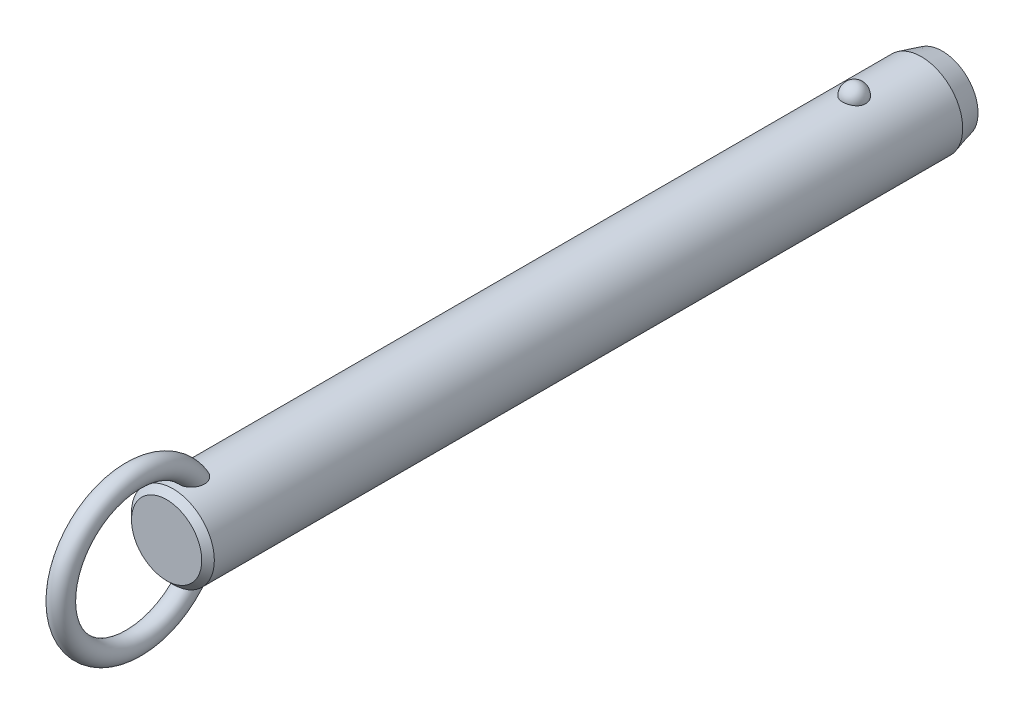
ISO-10303-21;
HEADER;
FILE_DESCRIPTION(('STEP AP214'),'2;1');
FILE_NAME('part.step','',(''),(''),'','','');
FILE_SCHEMA(('AUTOMOTIVE_DESIGN { 1 0 10303 214 1 1 1 1 }'));
ENDSEC;
DATA;
#1=APPLICATION_CONTEXT('core data for automotive mechanical design processes');
#2=APPLICATION_PROTOCOL_DEFINITION('international standard','automotive_design',2000,#1);
#3=PRODUCT_CONTEXT('',#1,'mechanical');
#4=PRODUCT('Part','Part','',(#3));
#5=PRODUCT_RELATED_PRODUCT_CATEGORY('part','',(#4));
#6=PRODUCT_DEFINITION_FORMATION('','',#4);
#7=PRODUCT_DEFINITION_CONTEXT('part definition',#1,'design');
#8=PRODUCT_DEFINITION('design','',#6,#7);
#9=PRODUCT_DEFINITION_SHAPE('','',#8);
#10=(LENGTH_UNIT() NAMED_UNIT(*) SI_UNIT(.MILLI.,.METRE.));
#11=(NAMED_UNIT(*) PLANE_ANGLE_UNIT() SI_UNIT($,.RADIAN.));
#12=(NAMED_UNIT(*) SI_UNIT($,.STERADIAN.) SOLID_ANGLE_UNIT());
#13=UNCERTAINTY_MEASURE_WITH_UNIT(LENGTH_MEASURE(1.E-05),#10,'distance_accuracy_value','');
#14=(GEOMETRIC_REPRESENTATION_CONTEXT(3) GLOBAL_UNCERTAINTY_ASSIGNED_CONTEXT((#13)) GLOBAL_UNIT_ASSIGNED_CONTEXT((#10,
#11,#12)) REPRESENTATION_CONTEXT('',''));
#15=CARTESIAN_POINT('',(0.,0.,0.));
#16=DIRECTION('',(0.,0.,1.));
#17=DIRECTION('',(1.,0.,0.));
#18=AXIS2_PLACEMENT_3D('',#15,#16,#17);
#19=CARTESIAN_POINT('',(0.,0.,119.4));
#20=DIRECTION('',(0.,0.,-1.));
#21=DIRECTION('',(-1.,0.,0.));
#22=AXIS2_PLACEMENT_3D('',#19,#20,#21);
#23=CYLINDRICAL_SURFACE('',#22,7.9);
#24=CARTESIAN_POINT('',(2.1785689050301,7.59367088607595,-2.19999999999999));
#25=CARTESIAN_POINT('',(2.17856679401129,7.59367269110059,-2.07701843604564));
#26=CARTESIAN_POINT('',(2.16853481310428,7.59657145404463,-1.95401006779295));
#27=CARTESIAN_POINT('',(2.12864689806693,7.607843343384,-1.71147811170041));
#28=CARTESIAN_POINT('',(2.09878338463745,7.61621856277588,-1.59195587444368));
#29=CARTESIAN_POINT('',(2.0199931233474,7.63749180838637,-1.3598563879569));
#30=CARTESIAN_POINT('',(1.97107475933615,7.6503878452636,-1.24727610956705));
#31=CARTESIAN_POINT('',(1.85539377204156,7.67926115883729,-1.03213234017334));
#32=CARTESIAN_POINT('',(1.78863158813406,7.69523835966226,-0.929568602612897));
#33=CARTESIAN_POINT('',(1.63856494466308,7.7285848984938,-0.736786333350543));
#34=CARTESIAN_POINT('',(1.55518140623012,7.7459606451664,-0.646630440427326));
#35=CARTESIAN_POINT('',(1.37422937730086,7.78009978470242,-0.481747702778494));
#36=CARTESIAN_POINT('',(1.27666086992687,7.79686317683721,-0.407020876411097));
#37=CARTESIAN_POINT('',(1.07024728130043,7.82786153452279,-0.275278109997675));
#38=CARTESIAN_POINT('',(0.961434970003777,7.84210353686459,-0.218212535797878));
#39=CARTESIAN_POINT('',(0.735351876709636,7.86652194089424,-0.123146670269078));
#40=CARTESIAN_POINT('',(0.618082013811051,7.87669878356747,-0.085144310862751));
#41=CARTESIAN_POINT('',(0.380637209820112,7.89170521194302,-0.0298158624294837));
#42=CARTESIAN_POINT('',(0.260550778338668,7.89662650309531,-0.0121347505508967));
#43=CARTESIAN_POINT('',(0.0190117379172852,7.90090003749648,0.00324379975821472));
#44=CARTESIAN_POINT('',(-0.102440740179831,7.90025280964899,0.00094313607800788));
#45=CARTESIAN_POINT('',(-0.341452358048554,7.89351056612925,-0.0233955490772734));
#46=CARTESIAN_POINT('',(-0.459042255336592,7.88749257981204,-0.0451545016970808));
#47=CARTESIAN_POINT('',(-0.688796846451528,7.87075812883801,-0.107408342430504));
#48=CARTESIAN_POINT('',(-0.800961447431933,7.86004158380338,-0.147903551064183));
#49=CARTESIAN_POINT('',(-1.01743634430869,7.83497131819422,-0.246799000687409));
#50=CARTESIAN_POINT('',(-1.12169791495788,7.82059709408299,-0.305300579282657));
#51=CARTESIAN_POINT('',(-1.31891765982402,7.78976470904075,-0.438549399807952));
#52=CARTESIAN_POINT('',(-1.41187469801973,7.77330633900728,-0.513298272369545));
#53=CARTESIAN_POINT('',(-1.58577142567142,7.73972434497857,-0.678622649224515));
#54=CARTESIAN_POINT('',(-1.66645140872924,7.72259402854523,-0.769470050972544));
#55=CARTESIAN_POINT('',(-1.81161503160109,7.68983776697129,-0.963538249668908));
#56=CARTESIAN_POINT('',(-1.87609753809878,7.6742119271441,-1.06675991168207));
#57=CARTESIAN_POINT('',(-1.98790138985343,7.6460202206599,-1.28401170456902));
#58=CARTESIAN_POINT('',(-2.03501994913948,7.63349104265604,-1.39815107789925));
#59=CARTESIAN_POINT('',(-2.10986724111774,7.6131449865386,-1.63301784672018));
#60=CARTESIAN_POINT('',(-2.1375965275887,7.60532797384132,-1.75374505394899));
#61=CARTESIAN_POINT('',(-2.17289256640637,7.5953195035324,-1.99782562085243));
#62=CARTESIAN_POINT('',(-2.18054294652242,7.59310471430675,-2.12116592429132));
#63=CARTESIAN_POINT('',(-2.17572919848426,7.59448538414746,-2.36741799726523));
#64=CARTESIAN_POINT('',(-2.1632656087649,7.59808068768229,-2.49032977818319));
#65=CARTESIAN_POINT('',(-2.11865035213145,7.61064035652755,-2.73161015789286));
#66=CARTESIAN_POINT('',(-2.08659579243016,7.61957823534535,-2.84999812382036));
#67=CARTESIAN_POINT('',(-2.00367799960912,7.64179982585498,-3.07955956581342));
#68=CARTESIAN_POINT('',(-1.9528140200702,7.65508371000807,-3.19073275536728));
#69=CARTESIAN_POINT('',(-1.83321113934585,7.68460381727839,-3.40337899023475));
#70=CARTESIAN_POINT('',(-1.76437735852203,7.70085556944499,-3.50479651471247));
#71=CARTESIAN_POINT('',(-1.61069526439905,7.73445734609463,-3.69446912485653));
#72=CARTESIAN_POINT('',(-1.52584634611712,7.75180741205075,-3.78272371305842));
#73=CARTESIAN_POINT('',(-1.34198059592,7.78574608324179,-3.94393987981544));
#74=CARTESIAN_POINT('',(-1.24291308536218,7.80233167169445,-4.01684434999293));
#75=CARTESIAN_POINT('',(-1.03352039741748,7.83281625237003,-4.14489386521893));
#76=CARTESIAN_POINT('',(-0.92319600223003,7.84671543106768,-4.20004014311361));
#77=CARTESIAN_POINT('',(-0.695822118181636,7.87011575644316,-4.29042017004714));
#78=CARTESIAN_POINT('',(-0.578872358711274,7.87966903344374,-4.32589112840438));
#79=CARTESIAN_POINT('',(-0.340410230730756,7.8935652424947,-4.37692226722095));
#80=CARTESIAN_POINT('',(-0.218898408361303,7.89790879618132,-4.39248482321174));
#81=CARTESIAN_POINT('',(0.0228107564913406,7.90087453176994,-4.40314405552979));
#82=CARTESIAN_POINT('',(0.142990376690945,7.89960185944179,-4.39861683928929));
#83=CARTESIAN_POINT('',(0.380829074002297,7.89171262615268,-4.37008293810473));
#84=CARTESIAN_POINT('',(0.498488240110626,7.8850962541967,-4.34607694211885));
#85=CARTESIAN_POINT('',(0.727535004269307,7.86726442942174,-4.27939317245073));
#86=CARTESIAN_POINT('',(0.838944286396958,7.85606616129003,-4.236785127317));
#87=CARTESIAN_POINT('',(1.05295421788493,7.83025654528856,-4.13408348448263));
#88=CARTESIAN_POINT('',(1.15555431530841,7.81564498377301,-4.07398879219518));
#89=CARTESIAN_POINT('',(1.35076763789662,7.7843022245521,-3.93687432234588));
#90=CARTESIAN_POINT('',(1.4432046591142,7.76754209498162,-3.85961036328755));
#91=CARTESIAN_POINT('',(1.6139111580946,7.73387857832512,-3.69076949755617));
#92=CARTESIAN_POINT('',(1.6921781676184,7.71697516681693,-3.59919010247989));
#93=CARTESIAN_POINT('',(1.83380875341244,7.6845643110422,-3.40247278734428));
#94=CARTESIAN_POINT('',(1.89689280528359,7.66908588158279,-3.29712873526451));
#95=CARTESIAN_POINT('',(2.0047823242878,7.64159441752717,-3.07707931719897));
#96=CARTESIAN_POINT('',(2.0495945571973,7.62958010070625,-2.96237743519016));
#97=CARTESIAN_POINT('',(2.11580183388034,7.61146617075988,-2.74040519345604));
#98=CARTESIAN_POINT('',(2.13929812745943,7.60484503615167,-2.63379846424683));
#99=CARTESIAN_POINT('',(2.17068242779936,7.59594664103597,-2.41813481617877));
#100=CARTESIAN_POINT('',(2.17857077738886,7.59366928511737,-2.30907795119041));
#101=CARTESIAN_POINT('',(2.1785689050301,7.59367088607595,-2.19999999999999));
#102=B_SPLINE_CURVE_WITH_KNOTS('',3,(#24,#25,#26,#27,#28,#29,#30,#31,#32,#33,#34,#35,#36,#37,
#38,#39,#40,#41,#42,#43,#44,#45,#46,#47,#48,#49,#50,#51,#52,#53,#54,#55,#56,#57,#58,#59,#60,#61,
#62,#63,#64,#65,#66,#67,#68,#69,#70,#71,#72,#73,#74,#75,#76,#77,#78,#79,#80,#81,#82,#83,#84,#85,
#86,#87,#88,#89,#90,#91,#92,#93,#94,#95,#96,#97,#98,#99,#100,#101),.UNSPECIFIED.,.T.,.F.,(4,2,2,
2,2,2,2,2,2,2,2,2,2,2,2,2,2,2,2,2,2,2,2,2,2,2,2,2,2,2,2,2,2,2,2,2,2,2,4),(0.,0.368552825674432,
0.737246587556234,1.10577831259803,1.4743009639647,1.8446206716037,2.21494081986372,
2.5842105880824,2.95344028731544,3.31611630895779,3.67875788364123,4.03628044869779,
4.39380913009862,4.75338791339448,5.11300280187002,5.47939989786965,5.8458226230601,
6.21639834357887,6.58696347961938,6.95598276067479,7.32499216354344,7.69218715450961,
8.0593967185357,8.42858578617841,8.79778880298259,9.16834203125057,9.5388695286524,
9.90482699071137,10.2707407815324,10.6298333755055,10.9889132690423,11.3466585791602,
11.7044262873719,12.0676511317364,12.4309391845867,12.8004764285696,13.1698767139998,
13.4967701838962,13.8236564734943),.UNSPECIFIED.);
#103=CARTESIAN_POINT('',(2.1785689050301,7.59367088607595,-2.19999999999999));
#104=VERTEX_POINT('',#103);
#105=EDGE_CURVE('E41',#104,#104,#102,.T.);
#106=ORIENTED_EDGE('',*,*,#105,.T.);
#107=EDGE_LOOP('',(#106));
#108=FACE_BOUND('',#107,.T.);
#109=CARTESIAN_POINT('',(0.,0.,127.72));
#110=DIRECTION('',(0.,0.,1.));
#111=DIRECTION('',(1.,0.,0.));
#112=AXIS2_PLACEMENT_3D('',#109,#110,#111);
#113=CIRCLE('',#112,7.9);
#114=CARTESIAN_POINT('',(7.9,0.,127.72));
#115=VERTEX_POINT('',#114);
#116=EDGE_CURVE('E10',#115,#115,#113,.F.);
#117=ORIENTED_EDGE('',*,*,#116,.T.);
#118=EDGE_LOOP('',(#117));
#119=FACE_BOUND('',#118,.T.);
#120=CARTESIAN_POINT('',(-0.630969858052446,-7.87476203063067,121.612432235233));
#121=CARTESIAN_POINT('',(-0.73418033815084,-7.8664899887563,121.647285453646));
#122=CARTESIAN_POINT('',(-0.834476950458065,-7.85639291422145,121.690816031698));
#123=CARTESIAN_POINT('',(-1.02620356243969,-7.83366343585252,121.794094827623));
#124=CARTESIAN_POINT('',(-1.1176141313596,-7.82102565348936,121.853877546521));
#125=CARTESIAN_POINT('',(-1.28877277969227,-7.79464922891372,121.987839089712));
#126=CARTESIAN_POINT('',(-1.36854014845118,-7.78091246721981,122.061993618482));
#127=CARTESIAN_POINT('',(-1.5146152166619,-7.75380398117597,122.222494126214));
#128=CARTESIAN_POINT('',(-1.58092966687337,-7.74043207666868,122.308833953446));
#129=CARTESIAN_POINT('',(-1.70019064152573,-7.71512522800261,122.492978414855));
#130=CARTESIAN_POINT('',(-1.75284037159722,-7.70322473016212,122.590979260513));
#131=CARTESIAN_POINT('',(-1.84263464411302,-7.68224112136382,122.794102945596));
#132=CARTESIAN_POINT('',(-1.87977299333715,-7.6731591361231,122.899228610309));
#133=CARTESIAN_POINT('',(-1.94152728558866,-7.65777930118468,123.123284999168));
#134=CARTESIAN_POINT('',(-1.96475471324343,-7.65179654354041,123.242616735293));
#135=CARTESIAN_POINT('',(-1.99449499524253,-7.64409642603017,123.48342986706));
#136=CARTESIAN_POINT('',(-2.0010005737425,-7.64238092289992,123.604912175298));
#137=CARTESIAN_POINT('',(-1.99856014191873,-7.64302120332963,123.868340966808));
#138=CARTESIAN_POINT('',(-1.98680021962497,-7.64611845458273,124.01025654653));
#139=CARTESIAN_POINT('',(-1.94457772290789,-7.65696186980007,124.291118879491));
#140=CARTESIAN_POINT('',(-1.91409393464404,-7.66471330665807,124.430062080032));
#141=CARTESIAN_POINT('',(-1.82768670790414,-7.68582947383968,124.731939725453));
#142=CARTESIAN_POINT('',(-1.76772963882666,-7.70003779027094,124.893686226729));
#143=CARTESIAN_POINT('',(-1.65998501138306,-7.72371550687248,125.127695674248));
#144=CARTESIAN_POINT('',(-1.62107967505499,-7.73200670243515,125.204297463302));
#145=CARTESIAN_POINT('',(-1.53727726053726,-7.7491037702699,125.354079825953));
#146=CARTESIAN_POINT('',(-1.4923821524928,-7.75790947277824,125.427261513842));
#147=CARTESIAN_POINT('',(-1.37397050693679,-7.77993338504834,125.60288382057));
#148=CARTESIAN_POINT('',(-1.29690364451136,-7.79328473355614,125.702955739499));
#149=CARTESIAN_POINT('',(-1.1288548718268,-7.81939266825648,125.890714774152));
#150=CARTESIAN_POINT('',(-1.03789926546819,-7.83215032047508,125.978424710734));
#151=CARTESIAN_POINT('',(-0.869532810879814,-7.85231710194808,126.113414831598));
#152=CARTESIAN_POINT('',(-0.795716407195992,-7.86021093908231,126.165076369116));
#153=CARTESIAN_POINT('',(-0.640813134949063,-7.87434920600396,126.256381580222));
#154=CARTESIAN_POINT('',(-0.559737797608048,-7.88059619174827,126.29604389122));
#155=CARTESIAN_POINT('',(-0.406456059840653,-7.88984116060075,126.354300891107));
#156=CARTESIAN_POINT('',(-0.335227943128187,-7.89321892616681,126.375384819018));
#157=CARTESIAN_POINT('',(-0.190193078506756,-7.89804235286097,126.40541418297));
#158=CARTESIAN_POINT('',(-0.116388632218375,-7.89948969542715,126.414370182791));
#159=CARTESIAN_POINT('',(0.0318414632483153,-7.90028409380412,126.419291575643));
#160=CARTESIAN_POINT('',(0.106268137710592,-7.89962640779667,126.415227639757));
#161=CARTESIAN_POINT('',(0.253290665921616,-7.8962818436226,126.394461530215));
#162=CARTESIAN_POINT('',(0.325885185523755,-7.8935935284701,126.377750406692));
#163=CARTESIAN_POINT('',(0.481441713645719,-7.88577340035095,126.328738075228));
#164=CARTESIAN_POINT('',(0.56361107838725,-7.88026321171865,126.294005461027));
#165=CARTESIAN_POINT('',(0.721129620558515,-7.86741729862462,126.211796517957));
#166=CARTESIAN_POINT('',(0.796466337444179,-7.86007832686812,126.164297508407));
#167=CARTESIAN_POINT('',(0.971456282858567,-7.84073285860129,126.036513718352));
#168=CARTESIAN_POINT('',(1.06719686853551,-7.82809461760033,125.951004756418));
#169=CARTESIAN_POINT('',(1.24418921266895,-7.80192439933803,125.766232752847));
#170=CARTESIAN_POINT('',(1.32540832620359,-7.78839049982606,125.666939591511));
#171=CARTESIAN_POINT('',(1.45199971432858,-7.76559693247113,125.489576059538));
#172=CARTESIAN_POINT('',(1.50085649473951,-7.75626094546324,125.413954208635));
#173=CARTESIAN_POINT('',(1.59197749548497,-7.7380727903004,125.258742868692));
#174=CARTESIAN_POINT('',(1.63423919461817,-7.72922080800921,125.179151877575));
#175=CARTESIAN_POINT('',(1.71222612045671,-7.71231959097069,125.016664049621));
#176=CARTESIAN_POINT('',(1.74794516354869,-7.70427111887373,124.933764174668));
#177=CARTESIAN_POINT('',(1.81270113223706,-7.68929240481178,124.765296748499));
#178=CARTESIAN_POINT('',(1.84173789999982,-7.68236218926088,124.679729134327));
#179=CARTESIAN_POINT('',(1.89322698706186,-7.6698375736,124.50528702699));
#180=CARTESIAN_POINT('',(1.91558744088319,-7.66426199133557,124.416383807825));
#181=CARTESIAN_POINT('',(1.95281367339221,-7.65485915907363,124.236969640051));
#182=CARTESIAN_POINT('',(1.96767946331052,-7.65103190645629,124.146458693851));
#183=CARTESIAN_POINT('',(2.00021456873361,-7.64262981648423,123.873732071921));
#184=CARTESIAN_POINT('',(2.00600691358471,-7.6410871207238,123.689709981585));
#185=CARTESIAN_POINT('',(1.98445334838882,-7.64669564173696,123.376501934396));
#186=CARTESIAN_POINT('',(1.96607186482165,-7.65149688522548,123.246618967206));
#187=CARTESIAN_POINT('',(1.90884967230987,-7.6659762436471,122.991632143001));
#188=CARTESIAN_POINT('',(1.87002101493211,-7.67565148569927,122.866525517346));
#189=CARTESIAN_POINT('',(1.77063986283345,-7.69918471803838,122.62454013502));
#190=CARTESIAN_POINT('',(1.7099372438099,-7.71307150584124,122.507725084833));
#191=CARTESIAN_POINT('',(1.56733070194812,-7.74330306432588,122.288144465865));
#192=CARTESIAN_POINT('',(1.48543692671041,-7.75964665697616,122.185372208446));
#193=CARTESIAN_POINT('',(1.31346177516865,-7.79047523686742,122.009380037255));
#194=CARTESIAN_POINT('',(1.22547278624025,-7.80495298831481,121.934106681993));
#195=CARTESIAN_POINT('',(1.03724352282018,-7.83218597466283,121.800486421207));
#196=CARTESIAN_POINT('',(0.937008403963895,-7.84494192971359,121.742132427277));
#197=CARTESIAN_POINT('',(0.733599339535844,-7.86649045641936,121.647027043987));
#198=CARTESIAN_POINT('',(0.630941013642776,-7.87547134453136,121.609210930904));
#199=CARTESIAN_POINT('',(0.420465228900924,-7.88950708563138,121.551116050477));
#200=CARTESIAN_POINT('',(0.31264590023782,-7.89456050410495,121.53084369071));
#201=CARTESIAN_POINT('',(0.0960869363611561,-7.9001518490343,121.508455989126));
#202=CARTESIAN_POINT('',(-0.0126341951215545,-7.90073226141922,121.506169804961));
#203=CARTESIAN_POINT('',(-0.22876680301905,-7.89742350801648,121.519367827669));
#204=CARTESIAN_POINT('',(-0.336180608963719,-7.89354403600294,121.534813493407));
#205=CARTESIAN_POINT('',(-0.473410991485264,-7.88586871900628,121.566217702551));
#206=CARTESIAN_POINT('',(-0.505257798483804,-7.88388984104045,121.574354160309));
#207=CARTESIAN_POINT('',(-0.568481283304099,-7.87958326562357,121.592208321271));
#208=CARTESIAN_POINT('',(-0.599857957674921,-7.87725556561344,121.601926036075));
#209=CARTESIAN_POINT('',(-0.630969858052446,-7.87476203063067,121.612432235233));
#210=B_SPLINE_CURVE_WITH_KNOTS('',3,(#120,#121,#122,#123,#124,#125,#126,#127,#128,#129,#130,
#131,#132,#133,#134,#135,#136,#137,#138,#139,#140,#141,#142,#143,#144,#145,#146,#147,#148,#149,
#150,#151,#152,#153,#154,#155,#156,#157,#158,#159,#160,#161,#162,#163,#164,#165,#166,#167,#168,
#169,#170,#171,#172,#173,#174,#175,#176,#177,#178,#179,#180,#181,#182,#183,#184,#185,#186,#187,
#188,#189,#190,#191,#192,#193,#194,#195,#196,#197,#198,#199,#200,#201,#202,#203,#204,#205,#206,
#207,#208,#209),.UNSPECIFIED.,.T.,.F.,(4,2,2,2,2,2,2,2,2,2,2,2,2,2,2,2,2,2,2,2,2,2,2,2,2,2,2,2,
2,2,2,2,2,2,2,2,2,2,2,2,2,2,2,2,4),(0.,0.327622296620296,0.655945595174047,0.983718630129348,
1.3113267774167,1.64554655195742,1.9798996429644,2.3436572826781,2.70757317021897,
3.13333684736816,3.55958380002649,4.07655306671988,4.33527897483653,4.593919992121,
4.9738243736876,5.35301797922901,5.62348245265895,5.89352465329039,6.11565959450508,
6.33760092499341,6.56004255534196,6.78264174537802,7.0493084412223,7.31645206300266,
7.70130871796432,8.08701995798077,8.35824509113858,8.62957365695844,8.90115735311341,
9.17274746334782,9.44791855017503,9.72308922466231,10.2715298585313,10.6638393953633,
11.0559179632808,11.4507403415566,11.845374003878,12.1936425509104,12.5417649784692,
12.8695063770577,13.1973674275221,13.5221104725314,13.8461490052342,13.9449071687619,
14.0436660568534),.UNSPECIFIED.);
#211=CARTESIAN_POINT('',(-0.630969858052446,-7.87476203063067,121.612432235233));
#212=VERTEX_POINT('',#211);
#213=EDGE_CURVE('E59',#212,#212,#210,.T.);
#214=ORIENTED_EDGE('',*,*,#213,.T.);
#215=EDGE_LOOP('',(#214));
#216=FACE_BOUND('',#215,.T.);
#217=CARTESIAN_POINT('',(-0.630969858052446,7.87476203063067,121.612432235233));
#218=CARTESIAN_POINT('',(-0.528918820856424,7.88293636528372,121.577979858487));
#219=CARTESIAN_POINT('',(-0.423745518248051,7.8893481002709,121.551915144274));
#220=CARTESIAN_POINT('',(-0.210236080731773,7.8979273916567,121.517282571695));
#221=CARTESIAN_POINT('',(-0.10189380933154,7.90008607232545,121.508751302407));
#222=CARTESIAN_POINT('',(0.114660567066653,7.89990877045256,121.509457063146));
#223=CARTESIAN_POINT('',(0.222872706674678,7.89757640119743,121.51867980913));
#224=CARTESIAN_POINT('',(0.436107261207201,7.88867538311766,121.554652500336));
#225=CARTESIAN_POINT('',(0.541131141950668,7.8821087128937,121.58139425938));
#226=CARTESIAN_POINT('',(0.745085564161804,7.86545130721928,121.651756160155));
#227=CARTESIAN_POINT('',(0.844015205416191,7.85536005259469,121.695378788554));
#228=CARTESIAN_POINT('',(1.03299167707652,7.83275153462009,121.798379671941));
#229=CARTESIAN_POINT('',(1.12303841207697,7.8202342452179,121.857758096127));
#230=CARTESIAN_POINT('',(1.29214734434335,7.79408219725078,121.990864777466));
#231=CARTESIAN_POINT('',(1.37116907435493,7.78044359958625,122.064643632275));
#232=CARTESIAN_POINT('',(1.51597677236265,7.75353170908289,122.224235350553));
#233=CARTESIAN_POINT('',(1.58176261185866,7.74025841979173,122.310048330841));
#234=CARTESIAN_POINT('',(1.70057386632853,7.71504069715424,122.493644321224));
#235=CARTESIAN_POINT('',(1.75320073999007,7.70314257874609,122.591690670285));
#236=CARTESIAN_POINT('',(1.84293767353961,7.68216822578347,122.794893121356));
#237=CARTESIAN_POINT('',(1.88004278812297,7.67309289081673,122.900051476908));
#238=CARTESIAN_POINT('',(1.9417232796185,7.6577294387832,123.124167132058));
#239=CARTESIAN_POINT('',(1.96491037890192,7.65175648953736,123.243524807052));
#240=CARTESIAN_POINT('',(1.9945689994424,7.64407702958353,123.484384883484));
#241=CARTESIAN_POINT('',(2.00103304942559,7.64237242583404,123.60588821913));
#242=CARTESIAN_POINT('',(1.9985016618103,7.64303650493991,123.869368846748));
#243=CARTESIAN_POINT('',(1.98669038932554,7.64614714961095,124.011314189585));
#244=CARTESIAN_POINT('',(1.94436120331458,7.6570170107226,124.292228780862));
#245=CARTESIAN_POINT('',(1.91382203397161,7.66478150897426,124.431194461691));
#246=CARTESIAN_POINT('',(1.82728754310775,7.68592483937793,124.733111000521));
#247=CARTESIAN_POINT('',(1.76725778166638,7.70014685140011,124.894872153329));
#248=CARTESIAN_POINT('',(1.65939700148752,7.72384204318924,125.128891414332));
#249=CARTESIAN_POINT('',(1.62045187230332,7.73213852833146,125.205494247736));
#250=CARTESIAN_POINT('',(1.53656684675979,7.74924489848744,125.355273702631));
#251=CARTESIAN_POINT('',(1.4916289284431,7.75805461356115,125.428451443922));
#252=CARTESIAN_POINT('',(1.37317698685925,7.78007342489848,125.603952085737));
#253=CARTESIAN_POINT('',(1.29612360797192,7.79341423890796,125.703911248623));
#254=CARTESIAN_POINT('',(1.12812043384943,7.81949839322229,125.89145083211));
#255=CARTESIAN_POINT('',(1.03719688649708,7.83224280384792,125.979054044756));
#256=CARTESIAN_POINT('',(0.868871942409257,7.85239026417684,126.11389715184));
#257=CARTESIAN_POINT('',(0.795056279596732,7.86027769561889,126.165511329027));
#258=CARTESIAN_POINT('',(0.640160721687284,7.87440222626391,126.256720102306));
#259=CARTESIAN_POINT('',(0.559092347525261,7.88064188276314,126.296333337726));
#260=CARTESIAN_POINT('',(0.405820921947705,7.8898738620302,126.354505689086));
#261=CARTESIAN_POINT('',(0.334594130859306,7.89324577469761,126.375552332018));
#262=CARTESIAN_POINT('',(0.189568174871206,7.89805733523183,126.405507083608));
#263=CARTESIAN_POINT('',(0.115771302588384,7.89949866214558,126.414425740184));
#264=CARTESIAN_POINT('',(-0.0324359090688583,7.90028156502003,126.41927589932));
#265=CARTESIAN_POINT('',(-0.106847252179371,7.89961843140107,126.415178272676));
#266=CARTESIAN_POINT('',(-0.253834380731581,7.8962642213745,126.394351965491));
#267=CARTESIAN_POINT('',(-0.326408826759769,7.89357170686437,126.377614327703));
#268=CARTESIAN_POINT('',(-0.481962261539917,7.88574179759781,126.328539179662));
#269=CARTESIAN_POINT('',(-0.564145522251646,7.88022507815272,126.293763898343));
#270=CARTESIAN_POINT('',(-0.721685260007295,7.86736646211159,126.211468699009));
#271=CARTESIAN_POINT('',(-0.797029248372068,7.8600213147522,126.163926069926));
#272=CARTESIAN_POINT('',(-0.972044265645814,7.84066026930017,126.036026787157));
#273=CARTESIAN_POINT('',(-1.0677980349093,7.828012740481,125.950443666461));
#274=CARTESIAN_POINT('',(-1.24480531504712,7.80182621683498,125.765522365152));
#275=CARTESIAN_POINT('',(-1.32602618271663,7.78828530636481,125.666154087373));
#276=CARTESIAN_POINT('',(-1.4525983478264,7.76548487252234,125.488680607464));
#277=CARTESIAN_POINT('',(-1.5014385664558,7.75614818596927,125.413025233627));
#278=CARTESIAN_POINT('',(-1.59252410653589,7.73796020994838,125.257748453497));
#279=CARTESIAN_POINT('',(-1.63476690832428,7.729109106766,125.178125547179));
#280=CARTESIAN_POINT('',(-1.71271318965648,7.71221133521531,125.015575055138));
#281=CARTESIAN_POINT('',(-1.74841047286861,7.70416543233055,124.932644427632));
#282=CARTESIAN_POINT('',(-1.81311929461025,7.6891937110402,124.764116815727));
#283=CARTESIAN_POINT('',(-1.84213067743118,7.68226791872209,124.678519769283));
#284=CARTESIAN_POINT('',(-1.89356259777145,7.66975461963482,124.504025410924));
#285=CARTESIAN_POINT('',(-1.91589165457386,7.66418586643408,124.415099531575));
#286=CARTESIAN_POINT('',(-1.95305070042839,7.65479859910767,124.235642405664));
#287=CARTESIAN_POINT('',(-1.96788069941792,7.65098008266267,124.145111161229));
#288=CARTESIAN_POINT('',(-2.00030078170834,7.64260704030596,123.872327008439));
#289=CARTESIAN_POINT('',(-2.00600576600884,7.64108760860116,123.688271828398));
#290=CARTESIAN_POINT('',(-1.9842848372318,7.64673945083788,123.375080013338));
#291=CARTESIAN_POINT('',(-1.96583698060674,7.65155751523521,123.245240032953));
#292=CARTESIAN_POINT('',(-1.90848948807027,7.66606613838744,122.990361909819));
#293=CARTESIAN_POINT('',(-1.86960376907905,7.67575338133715,122.865320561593));
#294=CARTESIAN_POINT('',(-1.77013421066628,7.6993013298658,122.623500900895));
#295=CARTESIAN_POINT('',(-1.70940488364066,7.71318991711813,122.506784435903));
#296=CARTESIAN_POINT('',(-1.5667295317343,7.74342495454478,122.287340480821));
#297=CARTESIAN_POINT('',(-1.48478316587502,7.75977144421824,122.18461321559));
#298=CARTESIAN_POINT('',(-1.31266325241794,7.79061163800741,122.008643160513));
#299=CARTESIAN_POINT('',(-1.22456383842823,7.80509908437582,121.933358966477));
#300=CARTESIAN_POINT('',(-1.0362240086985,7.83231881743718,121.799865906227));
#301=CARTESIAN_POINT('',(-0.936015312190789,7.84505551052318,121.741613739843));
#302=CARTESIAN_POINT('',(-0.798824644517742,7.85957802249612,121.677540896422));
#303=CARTESIAN_POINT('',(-0.765787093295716,7.86286821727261,121.663224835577));
#304=CARTESIAN_POINT('',(-0.698939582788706,7.86909211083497,121.636436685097));
#305=CARTESIAN_POINT('',(-0.665129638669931,7.8720258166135,121.623964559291));
#306=CARTESIAN_POINT('',(-0.630969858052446,7.87476203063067,121.612432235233));
#307=B_SPLINE_CURVE_WITH_KNOTS('',3,(#217,#218,#219,#220,#221,#222,#223,#224,#225,#226,#227,
#228,#229,#230,#231,#232,#233,#234,#235,#236,#237,#238,#239,#240,#241,#242,#243,#244,#245,#246,
#247,#248,#249,#250,#251,#252,#253,#254,#255,#256,#257,#258,#259,#260,#261,#262,#263,#264,#265,
#266,#267,#268,#269,#270,#271,#272,#273,#274,#275,#276,#277,#278,#279,#280,#281,#282,#283,#284,
#285,#286,#287,#288,#289,#290,#291,#292,#293,#294,#295,#296,#297,#298,#299,#300,#301,#302,#303,
#304,#305,#306),.UNSPECIFIED.,.T.,.F.,(4,2,2,2,2,2,2,2,2,2,2,2,2,2,2,2,2,2,2,2,2,2,2,2,2,2,2,2,
2,2,2,2,2,2,2,2,2,2,2,2,2,2,2,2,4),(0.,0.323920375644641,0.648516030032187,0.97285063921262,
1.29703380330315,1.62126473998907,1.94549915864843,2.27089401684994,2.5962920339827,
2.93059633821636,3.26500707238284,3.62881644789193,3.99278833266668,4.41865421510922,
4.84500434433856,5.36209210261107,5.62087589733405,5.87957448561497,6.25918598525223,
6.63808782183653,6.90846748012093,7.17842501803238,7.40052350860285,7.62242871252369,
7.84483086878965,8.0673907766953,8.33414615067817,8.60137921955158,8.98641454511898,
9.37230415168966,9.64358673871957,9.91497268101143,10.1866142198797,10.4582620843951,
10.7334745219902,11.008686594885,11.5572126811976,11.9494246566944,12.3413699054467,
12.7359755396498,13.1305875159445,13.4791770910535,13.82687259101,13.9353013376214,
14.0437279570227),.UNSPECIFIED.);
#308=CARTESIAN_POINT('',(-0.630969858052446,7.87476203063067,121.612432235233));
#309=VERTEX_POINT('',#308);
#310=EDGE_CURVE('E67',#309,#309,#307,.T.);
#311=ORIENTED_EDGE('',*,*,#310,.T.);
#312=EDGE_LOOP('',(#311));
#313=FACE_BOUND('',#312,.T.);
#314=CARTESIAN_POINT('',(0.,0.,-14.9999999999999));
#315=DIRECTION('',(0.,0.,-1.));
#316=DIRECTION('',(-1.,0.,0.));
#317=AXIS2_PLACEMENT_3D('',#314,#315,#316);
#318=CIRCLE('',#317,7.9);
#319=CARTESIAN_POINT('',(-7.9,0.,-14.9999999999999));
#320=VERTEX_POINT('',#319);
#321=EDGE_CURVE('E56',#320,#320,#318,.F.);
#322=ORIENTED_EDGE('',*,*,#321,.T.);
#323=EDGE_LOOP('',(#322));
#324=FACE_BOUND('',#323,.T.);
#325=ADVANCED_FACE('F37',(#108,#119,#216,#313,#324),#23,.T.);
#326=CARTESIAN_POINT('',(0.,0.,-19.));
#327=DIRECTION('',(0.,0.,-1.));
#328=DIRECTION('',(-1.,0.,0.));
#329=AXIS2_PLACEMENT_3D('',#326,#327,#328);
#330=PLANE('',#329);
#331=CARTESIAN_POINT('',(0.,0.,-19.));
#332=DIRECTION('',(0.,0.,-1.));
#333=DIRECTION('',(-1.,0.,0.));
#334=AXIS2_PLACEMENT_3D('',#331,#332,#333);
#335=CIRCLE('',#334,6.8282032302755);
#336=CARTESIAN_POINT('',(-6.8282032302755,0.,-19.));
#337=VERTEX_POINT('',#336);
#338=EDGE_CURVE('E66',#337,#337,#335,.T.);
#339=ORIENTED_EDGE('',*,*,#338,.T.);
#340=EDGE_LOOP('',(#339));
#341=FACE_BOUND('',#340,.T.);
#342=ADVANCED_FACE('F85',(#341),#330,.T.);
#343=CARTESIAN_POINT('',(0.,0.,-19.));
#344=DIRECTION('',(0.,0.,1.));
#345=DIRECTION('',(1.,0.,0.));
#346=AXIS2_PLACEMENT_3D('',#343,#344,#345);
#347=CONICAL_SURFACE('',#346,6.8282032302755,0.261799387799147);
#348=ORIENTED_EDGE('',*,*,#321,.F.);
#349=EDGE_LOOP('',(#348));
#350=FACE_BOUND('',#349,.T.);
#351=ORIENTED_EDGE('',*,*,#338,.F.);
#352=EDGE_LOOP('',(#351));
#353=FACE_BOUND('',#352,.T.);
#354=ADVANCED_FACE('F83',(#350,#353),#347,.T.);
#355=CARTESIAN_POINT('',(0.,0.,128.92));
#356=DIRECTION('',(0.,0.,1.));
#357=DIRECTION('',(1.,0.,0.));
#358=AXIS2_PLACEMENT_3D('',#355,#356,#357);
#359=PLANE('',#358);
#360=CARTESIAN_POINT('',(0.,0.,128.92));
#361=DIRECTION('',(0.,0.,1.));
#362=DIRECTION('',(1.,0.,0.));
#363=AXIS2_PLACEMENT_3D('',#360,#361,#362);
#364=CIRCLE('',#363,6.69999999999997);
#365=CARTESIAN_POINT('',(6.69999999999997,0.,128.92));
#366=VERTEX_POINT('',#365);
#367=EDGE_CURVE('E50',#366,#366,#364,.T.);
#368=ORIENTED_EDGE('',*,*,#367,.T.);
#369=EDGE_LOOP('',(#368));
#370=FACE_BOUND('',#369,.T.);
#371=ADVANCED_FACE('F77',(#370),#359,.T.);
#372=CARTESIAN_POINT('',(0.,0.,135.25));
#373=DIRECTION('',(1.,0.,0.));
#374=DIRECTION('',(0.,0.,-1.));
#375=AXIS2_PLACEMENT_3D('',#372,#373,#374);
#376=TOROIDAL_SURFACE('',#375,13.85,2.);
#377=ORIENTED_EDGE('',*,*,#310,.F.);
#378=EDGE_LOOP('',(#377));
#379=FACE_BOUND('',#378,.T.);
#380=ORIENTED_EDGE('',*,*,#213,.F.);
#381=EDGE_LOOP('',(#380));
#382=FACE_BOUND('',#381,.T.);
#383=ADVANCED_FACE('F73',(#379,#382),#376,.T.);
#384=CARTESIAN_POINT('',(0.,0.,128.92));
#385=DIRECTION('',(0.,0.,-1.));
#386=DIRECTION('',(-1.,0.,0.));
#387=AXIS2_PLACEMENT_3D('',#384,#385,#386);
#388=CONICAL_SURFACE('',#387,6.69999999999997,0.785398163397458);
#389=ORIENTED_EDGE('',*,*,#116,.F.);
#390=EDGE_LOOP('',(#389));
#391=FACE_BOUND('',#390,.T.);
#392=ORIENTED_EDGE('',*,*,#367,.F.);
#393=EDGE_LOOP('',(#392));
#394=FACE_BOUND('',#393,.T.);
#395=ADVANCED_FACE('F39',(#391,#394),#388,.T.);
#396=CARTESIAN_POINT('',(0.,7.9,-2.19999999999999));
#397=DIRECTION('',(0.,1.,0.));
#398=DIRECTION('',(0.,0.,-1.));
#399=AXIS2_PLACEMENT_3D('',#396,#397,#398);
#400=SPHERICAL_SURFACE('',#399,2.2);
#401=ORIENTED_EDGE('',*,*,#105,.F.);
#402=EDGE_LOOP('',(#401));
#403=FACE_BOUND('',#402,.T.);
#404=ADVANCED_FACE('F79',(#403),#400,.T.);
#405=CLOSED_SHELL('',(#325,#342,#354,#371,#383,#395,#404));
#406=MANIFOLD_SOLID_BREP('B2',#405);
#407=ADVANCED_BREP_SHAPE_REPRESENTATION('',(#18,#406),#14);
#408=SHAPE_DEFINITION_REPRESENTATION(#9,#407);
ENDSEC;
END-ISO-10303-21;
